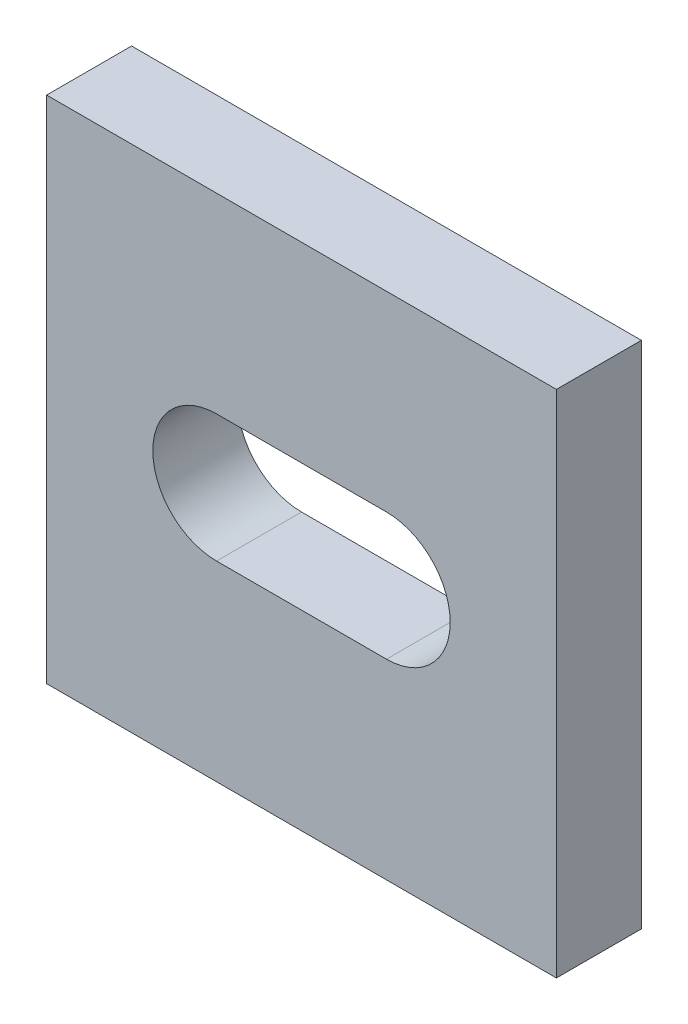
ISO-10303-21;
HEADER;
FILE_DESCRIPTION(('STEP AP214'),'2;1');
FILE_NAME('part.step','',(''),(''),'','','');
FILE_SCHEMA(('AUTOMOTIVE_DESIGN { 1 0 10303 214 1 1 1 1 }'));
ENDSEC;
DATA;
#1=APPLICATION_CONTEXT('core data for automotive mechanical design processes');
#2=APPLICATION_PROTOCOL_DEFINITION('international standard','automotive_design',2000,#1);
#3=PRODUCT_CONTEXT('',#1,'mechanical');
#4=PRODUCT('Part','Part','',(#3));
#5=PRODUCT_RELATED_PRODUCT_CATEGORY('part','',(#4));
#6=PRODUCT_DEFINITION_FORMATION('','',#4);
#7=PRODUCT_DEFINITION_CONTEXT('part definition',#1,'design');
#8=PRODUCT_DEFINITION('design','',#6,#7);
#9=PRODUCT_DEFINITION_SHAPE('','',#8);
#10=(LENGTH_UNIT() NAMED_UNIT(*) SI_UNIT(.MILLI.,.METRE.));
#11=(NAMED_UNIT(*) PLANE_ANGLE_UNIT() SI_UNIT($,.RADIAN.));
#12=(NAMED_UNIT(*) SI_UNIT($,.STERADIAN.) SOLID_ANGLE_UNIT());
#13=UNCERTAINTY_MEASURE_WITH_UNIT(LENGTH_MEASURE(1.E-05),#10,'distance_accuracy_value','');
#14=(GEOMETRIC_REPRESENTATION_CONTEXT(3) GLOBAL_UNCERTAINTY_ASSIGNED_CONTEXT((#13)) GLOBAL_UNIT_ASSIGNED_CONTEXT((#10,
#11,#12)) REPRESENTATION_CONTEXT('',''));
#15=CARTESIAN_POINT('',(0.,0.,0.));
#16=DIRECTION('',(0.,0.,1.));
#17=DIRECTION('',(1.,0.,0.));
#18=AXIS2_PLACEMENT_3D('',#15,#16,#17);
#19=CARTESIAN_POINT('',(0.,0.,10.));
#20=DIRECTION('',(1.,0.,0.));
#21=DIRECTION('',(0.,0.,-1.));
#22=AXIS2_PLACEMENT_3D('',#19,#20,#21);
#23=PLANE('',#22);
#24=DIRECTION('',(0.,-1.,0.));
#25=VECTOR('',#24,1.);
#26=CARTESIAN_POINT('',(0.,0.,0.));
#27=LINE('',#26,#25);
#28=CARTESIAN_POINT('',(0.,60.,0.));
#29=VERTEX_POINT('',#28);
#30=CARTESIAN_POINT('',(0.,0.,0.));
#31=VERTEX_POINT('',#30);
#32=EDGE_CURVE('E139',#29,#31,#27,.T.);
#33=ORIENTED_EDGE('',*,*,#32,.T.);
#34=DIRECTION('',(0.,0.,-1.));
#35=VECTOR('',#34,1.);
#36=CARTESIAN_POINT('',(0.,0.,10.));
#37=LINE('',#36,#35);
#38=CARTESIAN_POINT('',(0.,0.,10.));
#39=VERTEX_POINT('',#38);
#40=EDGE_CURVE('E11',#39,#31,#37,.T.);
#41=ORIENTED_EDGE('',*,*,#40,.F.);
#42=DIRECTION('',(0.,-1.,0.));
#43=VECTOR('',#42,1.);
#44=CARTESIAN_POINT('',(0.,0.,10.));
#45=LINE('',#44,#43);
#46=CARTESIAN_POINT('',(0.,60.,10.));
#47=VERTEX_POINT('',#46);
#48=EDGE_CURVE('E143',#47,#39,#45,.T.);
#49=ORIENTED_EDGE('',*,*,#48,.F.);
#50=DIRECTION('',(0.,0.,-1.));
#51=VECTOR('',#50,1.);
#52=CARTESIAN_POINT('',(0.,60.,10.));
#53=LINE('',#52,#51);
#54=EDGE_CURVE('E153',#47,#29,#53,.T.);
#55=ORIENTED_EDGE('',*,*,#54,.T.);
#56=EDGE_LOOP('',(#33,#41,#49,#55));
#57=FACE_BOUND('',#56,.T.);
#58=ADVANCED_FACE('F37',(#57),#23,.F.);
#59=CARTESIAN_POINT('',(0.,0.,10.));
#60=DIRECTION('',(0.,1.,0.));
#61=DIRECTION('',(0.,0.,1.));
#62=AXIS2_PLACEMENT_3D('',#59,#60,#61);
#63=PLANE('',#62);
#64=DIRECTION('',(1.,0.,0.));
#65=VECTOR('',#64,1.);
#66=CARTESIAN_POINT('',(0.,0.,0.));
#67=LINE('',#66,#65);
#68=CARTESIAN_POINT('',(60.,0.,0.));
#69=VERTEX_POINT('',#68);
#70=EDGE_CURVE('E156',#31,#69,#67,.T.);
#71=ORIENTED_EDGE('',*,*,#70,.T.);
#72=DIRECTION('',(0.,0.,-1.));
#73=VECTOR('',#72,1.);
#74=CARTESIAN_POINT('',(60.,0.,10.));
#75=LINE('',#74,#73);
#76=CARTESIAN_POINT('',(60.,0.,10.));
#77=VERTEX_POINT('',#76);
#78=EDGE_CURVE('E44',#77,#69,#75,.T.);
#79=ORIENTED_EDGE('',*,*,#78,.F.);
#80=DIRECTION('',(1.,0.,0.));
#81=VECTOR('',#80,1.);
#82=CARTESIAN_POINT('',(0.,0.,10.));
#83=LINE('',#82,#81);
#84=EDGE_CURVE('E146',#39,#77,#83,.T.);
#85=ORIENTED_EDGE('',*,*,#84,.F.);
#86=ORIENTED_EDGE('',*,*,#40,.T.);
#87=EDGE_LOOP('',(#71,#79,#85,#86));
#88=FACE_BOUND('',#87,.T.);
#89=ADVANCED_FACE('F184',(#88),#63,.F.);
#90=CARTESIAN_POINT('',(60.,0.,10.));
#91=DIRECTION('',(-1.,0.,0.));
#92=DIRECTION('',(0.,0.,1.));
#93=AXIS2_PLACEMENT_3D('',#90,#91,#92);
#94=PLANE('',#93);
#95=DIRECTION('',(0.,1.,0.));
#96=VECTOR('',#95,1.);
#97=CARTESIAN_POINT('',(60.,0.,0.));
#98=LINE('',#97,#96);
#99=CARTESIAN_POINT('',(60.,60.,0.));
#100=VERTEX_POINT('',#99);
#101=EDGE_CURVE('E158',#69,#100,#98,.T.);
#102=ORIENTED_EDGE('',*,*,#101,.T.);
#103=DIRECTION('',(0.,0.,-1.));
#104=VECTOR('',#103,1.);
#105=CARTESIAN_POINT('',(60.,60.,10.));
#106=LINE('',#105,#104);
#107=CARTESIAN_POINT('',(60.,60.,10.));
#108=VERTEX_POINT('',#107);
#109=EDGE_CURVE('E163',#108,#100,#106,.T.);
#110=ORIENTED_EDGE('',*,*,#109,.F.);
#111=DIRECTION('',(0.,1.,0.));
#112=VECTOR('',#111,1.);
#113=CARTESIAN_POINT('',(60.,0.,10.));
#114=LINE('',#113,#112);
#115=EDGE_CURVE('E149',#77,#108,#114,.T.);
#116=ORIENTED_EDGE('',*,*,#115,.F.);
#117=ORIENTED_EDGE('',*,*,#78,.T.);
#118=EDGE_LOOP('',(#102,#110,#116,#117));
#119=FACE_BOUND('',#118,.T.);
#120=ADVANCED_FACE('F170',(#119),#94,.F.);
#121=CARTESIAN_POINT('',(0.,60.,10.));
#122=DIRECTION('',(0.,-1.,0.));
#123=DIRECTION('',(0.,0.,-1.));
#124=AXIS2_PLACEMENT_3D('',#121,#122,#123);
#125=PLANE('',#124);
#126=DIRECTION('',(-1.,0.,0.));
#127=VECTOR('',#126,1.);
#128=CARTESIAN_POINT('',(0.,60.,0.));
#129=LINE('',#128,#127);
#130=EDGE_CURVE('E147',#100,#29,#129,.T.);
#131=ORIENTED_EDGE('',*,*,#130,.T.);
#132=ORIENTED_EDGE('',*,*,#54,.F.);
#133=DIRECTION('',(-1.,0.,0.));
#134=VECTOR('',#133,1.);
#135=CARTESIAN_POINT('',(0.,60.,10.));
#136=LINE('',#135,#134);
#137=EDGE_CURVE('E151',#108,#47,#136,.T.);
#138=ORIENTED_EDGE('',*,*,#137,.F.);
#139=ORIENTED_EDGE('',*,*,#109,.T.);
#140=EDGE_LOOP('',(#131,#132,#138,#139));
#141=FACE_BOUND('',#140,.T.);
#142=ADVANCED_FACE('F177',(#141),#125,.F.);
#143=CARTESIAN_POINT('',(0.,60.,10.));
#144=DIRECTION('',(0.,0.,-1.));
#145=DIRECTION('',(-1.,0.,0.));
#146=AXIS2_PLACEMENT_3D('',#143,#144,#145);
#147=PLANE('',#146);
#148=DIRECTION('',(1.,0.,0.));
#149=VECTOR('',#148,1.);
#150=CARTESIAN_POINT('',(20.,22.5,10.));
#151=LINE('',#150,#149);
#152=CARTESIAN_POINT('',(20.,22.5,10.));
#153=VERTEX_POINT('',#152);
#154=CARTESIAN_POINT('',(40.,22.5,10.));
#155=VERTEX_POINT('',#154);
#156=EDGE_CURVE('E133',#153,#155,#151,.T.);
#157=ORIENTED_EDGE('',*,*,#156,.F.);
#158=CARTESIAN_POINT('',(20.,30.,10.));
#159=DIRECTION('',(0.,0.,1.));
#160=DIRECTION('',(1.,0.,0.));
#161=AXIS2_PLACEMENT_3D('',#158,#159,#160);
#162=CIRCLE('',#161,7.50000000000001);
#163=CARTESIAN_POINT('',(20.,37.5,10.));
#164=VERTEX_POINT('',#163);
#165=EDGE_CURVE('E51',#164,#153,#162,.T.);
#166=ORIENTED_EDGE('',*,*,#165,.F.);
#167=DIRECTION('',(-1.,0.,0.));
#168=VECTOR('',#167,1.);
#169=CARTESIAN_POINT('',(20.,37.5,10.));
#170=LINE('',#169,#168);
#171=CARTESIAN_POINT('',(40.,37.5,10.));
#172=VERTEX_POINT('',#171);
#173=EDGE_CURVE('E123',#172,#164,#170,.T.);
#174=ORIENTED_EDGE('',*,*,#173,.F.);
#175=CARTESIAN_POINT('',(40.,30.,10.));
#176=DIRECTION('',(0.,0.,1.));
#177=DIRECTION('',(1.,0.,0.));
#178=AXIS2_PLACEMENT_3D('',#175,#176,#177);
#179=CIRCLE('',#178,7.50000000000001);
#180=EDGE_CURVE('E127',#155,#172,#179,.T.);
#181=ORIENTED_EDGE('',*,*,#180,.F.);
#182=EDGE_LOOP('',(#157,#166,#174,#181));
#183=FACE_BOUND('',#182,.T.);
#184=ORIENTED_EDGE('',*,*,#48,.T.);
#185=ORIENTED_EDGE('',*,*,#84,.T.);
#186=ORIENTED_EDGE('',*,*,#115,.T.);
#187=ORIENTED_EDGE('',*,*,#137,.T.);
#188=EDGE_LOOP('',(#184,#185,#186,#187));
#189=FACE_BOUND('',#188,.T.);
#190=ADVANCED_FACE('F183',(#183,#189),#147,.F.);
#191=CARTESIAN_POINT('',(0.,60.,0.));
#192=DIRECTION('',(0.,0.,-1.));
#193=DIRECTION('',(-1.,0.,0.));
#194=AXIS2_PLACEMENT_3D('',#191,#192,#193);
#195=PLANE('',#194);
#196=CARTESIAN_POINT('',(20.,30.,0.));
#197=DIRECTION('',(0.,0.,1.));
#198=DIRECTION('',(1.,0.,0.));
#199=AXIS2_PLACEMENT_3D('',#196,#197,#198);
#200=CIRCLE('',#199,7.50000000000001);
#201=CARTESIAN_POINT('',(20.,37.5,0.));
#202=VERTEX_POINT('',#201);
#203=CARTESIAN_POINT('',(20.,22.5,0.));
#204=VERTEX_POINT('',#203);
#205=EDGE_CURVE('E104',#202,#204,#200,.T.);
#206=ORIENTED_EDGE('',*,*,#205,.T.);
#207=DIRECTION('',(1.,0.,0.));
#208=VECTOR('',#207,1.);
#209=CARTESIAN_POINT('',(20.,22.5,0.));
#210=LINE('',#209,#208);
#211=CARTESIAN_POINT('',(40.,22.5,0.));
#212=VERTEX_POINT('',#211);
#213=EDGE_CURVE('E114',#204,#212,#210,.T.);
#214=ORIENTED_EDGE('',*,*,#213,.T.);
#215=CARTESIAN_POINT('',(40.,30.,0.));
#216=DIRECTION('',(0.,0.,1.));
#217=DIRECTION('',(1.,0.,0.));
#218=AXIS2_PLACEMENT_3D('',#215,#216,#217);
#219=CIRCLE('',#218,7.50000000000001);
#220=CARTESIAN_POINT('',(40.,37.5,0.));
#221=VERTEX_POINT('',#220);
#222=EDGE_CURVE('E59',#212,#221,#219,.T.);
#223=ORIENTED_EDGE('',*,*,#222,.T.);
#224=DIRECTION('',(-1.,0.,0.));
#225=VECTOR('',#224,1.);
#226=CARTESIAN_POINT('',(20.,37.5,0.));
#227=LINE('',#226,#225);
#228=EDGE_CURVE('E111',#221,#202,#227,.T.);
#229=ORIENTED_EDGE('',*,*,#228,.T.);
#230=EDGE_LOOP('',(#206,#214,#223,#229));
#231=FACE_BOUND('',#230,.T.);
#232=ORIENTED_EDGE('',*,*,#32,.F.);
#233=ORIENTED_EDGE('',*,*,#130,.F.);
#234=ORIENTED_EDGE('',*,*,#101,.F.);
#235=ORIENTED_EDGE('',*,*,#70,.F.);
#236=EDGE_LOOP('',(#232,#233,#234,#235));
#237=FACE_BOUND('',#236,.T.);
#238=ADVANCED_FACE('F119',(#231,#237),#195,.T.);
#239=CARTESIAN_POINT('',(20.,30.,0.));
#240=DIRECTION('',(0.,0.,1.));
#241=DIRECTION('',(1.,0.,0.));
#242=AXIS2_PLACEMENT_3D('',#239,#240,#241);
#243=CYLINDRICAL_SURFACE('',#242,7.50000000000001);
#244=ORIENTED_EDGE('',*,*,#165,.T.);
#245=DIRECTION('',(0.,0.,1.));
#246=VECTOR('',#245,1.);
#247=CARTESIAN_POINT('',(20.,22.5,0.));
#248=LINE('',#247,#246);
#249=EDGE_CURVE('E100',#204,#153,#248,.T.);
#250=ORIENTED_EDGE('',*,*,#249,.F.);
#251=ORIENTED_EDGE('',*,*,#205,.F.);
#252=DIRECTION('',(0.,0.,1.));
#253=VECTOR('',#252,1.);
#254=CARTESIAN_POINT('',(20.,37.5,0.));
#255=LINE('',#254,#253);
#256=EDGE_CURVE('E137',#202,#164,#255,.T.);
#257=ORIENTED_EDGE('',*,*,#256,.T.);
#258=EDGE_LOOP('',(#244,#250,#251,#257));
#259=FACE_BOUND('',#258,.T.);
#260=ADVANCED_FACE('F102',(#259),#243,.F.);
#261=CARTESIAN_POINT('',(20.,37.5,0.));
#262=DIRECTION('',(0.,1.,0.));
#263=DIRECTION('',(-1.,0.,0.));
#264=AXIS2_PLACEMENT_3D('',#261,#262,#263);
#265=PLANE('',#264);
#266=ORIENTED_EDGE('',*,*,#173,.T.);
#267=ORIENTED_EDGE('',*,*,#256,.F.);
#268=ORIENTED_EDGE('',*,*,#228,.F.);
#269=DIRECTION('',(0.,0.,1.));
#270=VECTOR('',#269,1.);
#271=CARTESIAN_POINT('',(40.,37.5,0.));
#272=LINE('',#271,#270);
#273=EDGE_CURVE('E140',#221,#172,#272,.T.);
#274=ORIENTED_EDGE('',*,*,#273,.T.);
#275=EDGE_LOOP('',(#266,#267,#268,#274));
#276=FACE_BOUND('',#275,.T.);
#277=ADVANCED_FACE('F201',(#276),#265,.F.);
#278=CARTESIAN_POINT('',(40.,30.,0.));
#279=DIRECTION('',(0.,0.,1.));
#280=DIRECTION('',(1.,0.,0.));
#281=AXIS2_PLACEMENT_3D('',#278,#279,#280);
#282=CYLINDRICAL_SURFACE('',#281,7.50000000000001);
#283=ORIENTED_EDGE('',*,*,#180,.T.);
#284=ORIENTED_EDGE('',*,*,#273,.F.);
#285=ORIENTED_EDGE('',*,*,#222,.F.);
#286=DIRECTION('',(0.,0.,1.));
#287=VECTOR('',#286,1.);
#288=CARTESIAN_POINT('',(40.,22.5,0.));
#289=LINE('',#288,#287);
#290=EDGE_CURVE('E110',#212,#155,#289,.T.);
#291=ORIENTED_EDGE('',*,*,#290,.T.);
#292=EDGE_LOOP('',(#283,#284,#285,#291));
#293=FACE_BOUND('',#292,.T.);
#294=ADVANCED_FACE('F204',(#293),#282,.F.);
#295=CARTESIAN_POINT('',(20.,22.5,0.));
#296=DIRECTION('',(0.,-1.,0.));
#297=DIRECTION('',(1.,0.,0.));
#298=AXIS2_PLACEMENT_3D('',#295,#296,#297);
#299=PLANE('',#298);
#300=ORIENTED_EDGE('',*,*,#156,.T.);
#301=ORIENTED_EDGE('',*,*,#290,.F.);
#302=ORIENTED_EDGE('',*,*,#213,.F.);
#303=ORIENTED_EDGE('',*,*,#249,.T.);
#304=EDGE_LOOP('',(#300,#301,#302,#303));
#305=FACE_BOUND('',#304,.T.);
#306=ADVANCED_FACE('F115',(#305),#299,.F.);
#307=CLOSED_SHELL('',(#58,#89,#120,#142,#190,#238,#260,#277,#294,#306));
#308=MANIFOLD_SOLID_BREP('B2',#307);
#309=ADVANCED_BREP_SHAPE_REPRESENTATION('',(#18,#308),#14);
#310=SHAPE_DEFINITION_REPRESENTATION(#9,#309);
ENDSEC;
END-ISO-10303-21;
